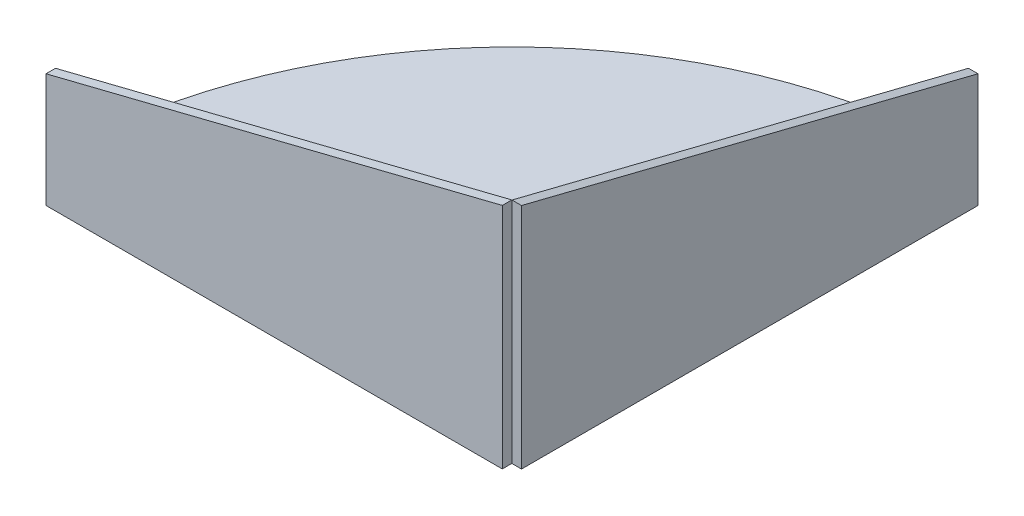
from build123d import *

# Parameters (mm, degrees)
EXTRUDE1_DEPTH = 12.7
EXTRUDE2_DEPTH = 12.7
EXTRUDE3_DEPTH = 12.7


with BuildPart() as part:
    # Sketch1 → Extrude1 (new body)
    with BuildSketch(Plane(origin=(0, 0, 0), x_dir=(1, 0, 0), z_dir=(0, 1, 0))):
        with BuildLine():
            Line((-304.8, -304.8), (304.8, -304.8))
            Line((304.8, -304.8), (304.8, 304.8))
            ThreePointArc((304.8, 304.8), (-126.252293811, 126.252293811), (-304.8, -304.8))
        make_face()
    extrude(amount=EXTRUDE1_DEPTH)

    # Sketch2 → Extrude2 (add)
    with BuildSketch(Plane(origin=(304.8, 0, 0), x_dir=(0, 0, -1), z_dir=(1, 0, 0))):
        Polygon((-304.8, 12.7), (-304.8, 266.7), (304.8, 114.3), (304.8, 12.7), (304.8, -38.1), (-304.8, -38.1), align=None)
    extrude(amount=EXTRUDE2_DEPTH)

    # Sketch3 → Extrude3 (add)
    with BuildSketch(Plane.XY.offset(304.8)):
        Polygon((304.546, 266.7), (304.546, -38.1), (-304.8, -38.1), (-304.8, 114.3), align=None)
    extrude(amount=EXTRUDE3_DEPTH)


solid = part.part
